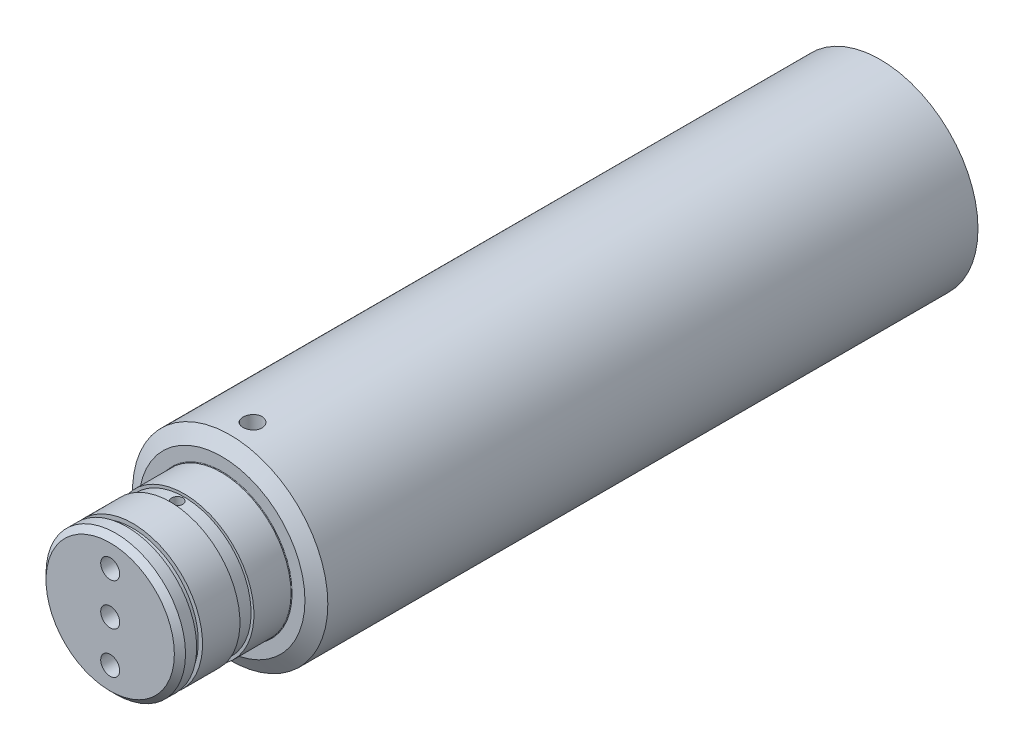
from build123d import *

# Parameters (mm, degrees)
ESQUISSE1_R            = 35
EXTRUSION1_DEPTH       = 236
CHANFREIN1_SIZE        = 3
CHANFREIN1_SIZE2       = 5.196152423
CHANFREIN2_SIZE        = 2
TROU_TARAUD_M81_D      = 6.8
TROU_TARAUD_M81_DEPTH  = 55
TROU_TARAUD_M81_TIP    = 2.042926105
TROU_TARAUD_M82_D      = 6.8
TROU_TARAUD_M82_DEPTH  = 34.999
TROU_TARAUD_M82_TIP    = 2.042926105
D_GAGEMENT_M3_51_D     = 4
D_GAGEMENT_M3_51_DEPTH = 34.999
D_GAGEMENT_M3_51_TIP   = 1.201721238
TROU_TARAUD_M84_D      = 6.8
TROU_TARAUD_M84_DEPTH  = 19.75
TROU_TARAUD_M84_TIP    = 2.042926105
ESQUISSE12_W           = 1.5
ESQUISSE12_H           = 2.1
CONG_1_R               = 0.2


with BuildPart() as part:
    # Esquisse1 → Extrusion1 (new body)
    with BuildSketch(Plane.XY):
        Circle(ESQUISSE1_R)
    extrude(amount=EXTRUSION1_DEPTH)

    # Chanfrein1
    chanfrein1_edges = [part.edges().sort_by_distance(p)[0] for p in [
        (-35, 0, 236),
    ]]
    chanfrein1_side = [part.faces().sort_by_distance(p)[0] for p in [
        (-35, 0, 118),
    ]]
    chamfer(chanfrein1_edges, length=CHANFREIN1_SIZE, length2=CHANFREIN1_SIZE2, reference=chanfrein1_side[0])

    # Esquisse2 → R_volution1 (revolve)
    with BuildSketch(Plane(origin=(0, 0, 0), x_dir=(0, 0, -1), z_dir=(1, 0, 0)), mode=Mode.PRIVATE) as r_volution1_sk:
        Polygon((-236, 25), (-249.5, 25), (-249.5, 24), (-254.5, 24), (-254.5, 25), (-276, 25), (-276, 0), (-236, 0), align=None)
    revolve(r_volution1_sk.sketch.rotate(Axis((0, 0, 187.852900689), (0, 0, 1)), 90), axis=Axis((0, 0, 187.852900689), (0, 0, 1)))

    # Chanfrein2
    chanfrein2_edges = [part.edges().sort_by_distance(p)[0] for p in [
        (25, 0, 276),
    ]]
    chamfer(chanfrein2_edges, length=CHANFREIN2_SIZE)

    # Trou taraud_ M81
    with Locations(Plane.XY.offset(276)):
        with Locations((0, 0)):
            Hole(TROU_TARAUD_M81_D / 2, depth=TROU_TARAUD_M81_DEPTH)
            with Locations((0, 0, -(TROU_TARAUD_M81_DEPTH + TROU_TARAUD_M81_TIP / 2))):  # 118° drill point
                Cone(0, TROU_TARAUD_M81_D / 2, TROU_TARAUD_M81_TIP, mode=Mode.SUBTRACT)

    # Trou taraud_ M82
    with Locations(Plane(origin=(0, 35, 0), x_dir=(-1, 0, 0), z_dir=(0, 1, 0))):
        with Locations((0, 225)):
            Hole(TROU_TARAUD_M82_D / 2, depth=TROU_TARAUD_M82_DEPTH)
            with Locations((0, 0, -(TROU_TARAUD_M82_DEPTH + TROU_TARAUD_M82_TIP / 2))):  # 118° drill point
                Cone(0, TROU_TARAUD_M82_D / 2, TROU_TARAUD_M82_TIP, mode=Mode.SUBTRACT)

    # D_gagement M3.51
    with Locations(Plane(origin=(0, 35, 0), x_dir=(-1, 0, 0), z_dir=(0, 1, 0))):
        with Locations((0, 252)):
            Hole(D_GAGEMENT_M3_51_D / 2, depth=D_GAGEMENT_M3_51_DEPTH)
            with Locations((0, 0, -(D_GAGEMENT_M3_51_DEPTH + D_GAGEMENT_M3_51_TIP / 2))):  # 118° drill point
                Cone(0, D_GAGEMENT_M3_51_D / 2, D_GAGEMENT_M3_51_TIP, mode=Mode.SUBTRACT)

    # Trou taraud_ M84
    with Locations(Plane.XY.offset(276)):
        with Locations((0, 15), (0, -15)):
            Hole(TROU_TARAUD_M84_D / 2, depth=TROU_TARAUD_M84_DEPTH)
            with Locations((0, 0, -(TROU_TARAUD_M84_DEPTH + TROU_TARAUD_M84_TIP / 2))):  # 118° drill point
                Cone(0, TROU_TARAUD_M84_D / 2, TROU_TARAUD_M84_TIP, mode=Mode.SUBTRACT)

    # Esquisse12 → Enl_vement de mati_re-R_volution1 (revolve, cut)
    with BuildSketch(Plane(origin=(0, 0, 0), x_dir=(1, 0, 0), z_dir=(0, 1, 0))):
        with Locations((-24.25, -268.95)):
            Rectangle(ESQUISSE12_W, ESQUISSE12_H)
    revolve(axis=Axis((0, 0, 187.852900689), (0, 0, 1)), mode=Mode.SUBTRACT)

    # Cong_1
    cong_1_edges = [part.edges().sort_by_distance(p)[0] for p in [
        (25, 0, 236),
    ]]
    fillet(cong_1_edges, radius=CONG_1_R)


solid = part.part
